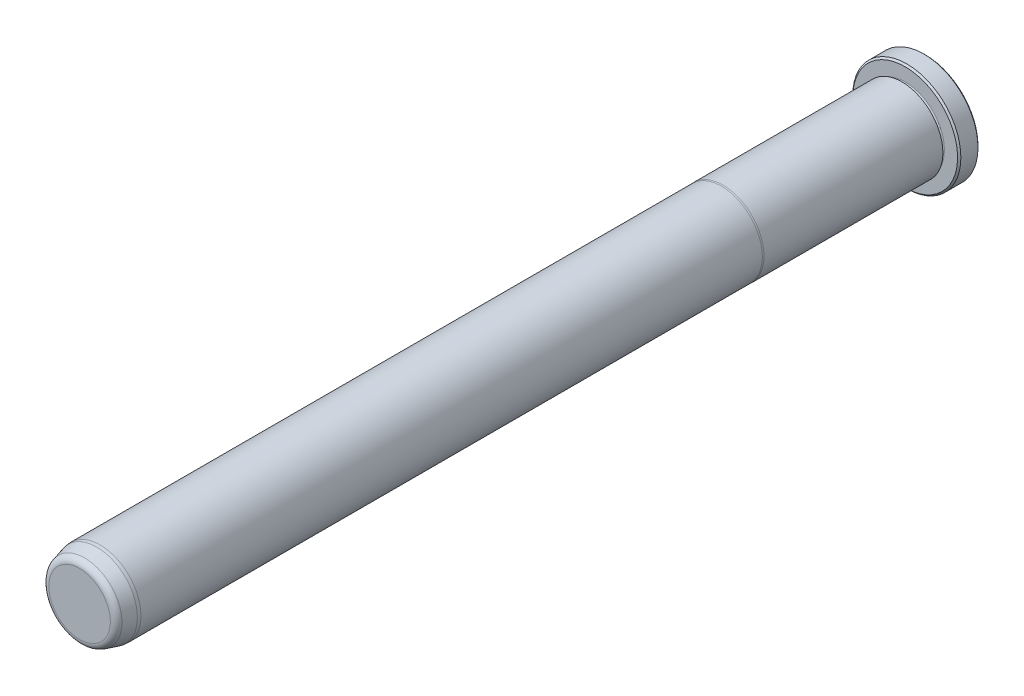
from build123d import *

# Parameters (mm, degrees)
FILLET6_R     = 1.5875
CHAMFER1_SIZE = 0.381


with BuildPart() as part:
    # Sketch1 → Revolve1 (revolve)
    with BuildSketch(Plane(origin=(0, 0, 0), x_dir=(0, 0, -1), z_dir=(1, 0, 0)), mode=Mode.PRIVATE) as revolve1_sk:
        with BuildLine():
            Line((0, 0), (0, 12.573))
            Line((0, 12.573), (-4.7498, 12.573))
            Line((-4.7498, 12.573), (-4.7498, 9.1313))
            ThreePointArc((-4.7498, 9.1313), (-5.1308, 8.7503), (-5.5118, 9.1313))
            Line((-5.5118, 9.1313), (-5.5118, 9.5377))
            Line((-5.5118, 9.5377), (-47.134763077, 9.5377))
            Line((-47.134763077, 9.5377), (-47.498, 9.5123))
            Line((-47.498, 9.5123), (-192.0875, 9.5123))
            Line((-192.0875, 9.5123), (-192.8495, 9.445633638))
            Line((-192.8495, 9.445633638), (-196.85, 8.373702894))
            Line((-196.85, 8.373702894), (-196.85, 0))
            Line((-196.85, 0), (0, 0))
        make_face()
    revolve(revolve1_sk.sketch.rotate(Axis((0, 0, 0), (0, 0, -1)), 90), axis=Axis((0, 0, 0), (0, 0, -1)))

    # Fillet6
    fillet6_edges = [part.edges().sort_by_distance(p)[0] for p in [
        (-8.373702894, 0, 196.85),
    ]]
    fillet(fillet6_edges, radius=FILLET6_R)

    # Chamfer1
    chamfer1_edges = [part.edges().sort_by_distance(p)[0] for p in [
        (-12.573, 0, 4.7498),
        (-12.573, 0, 0),
    ]]
    chamfer(chamfer1_edges, length=CHAMFER1_SIZE)


solid = part.part
